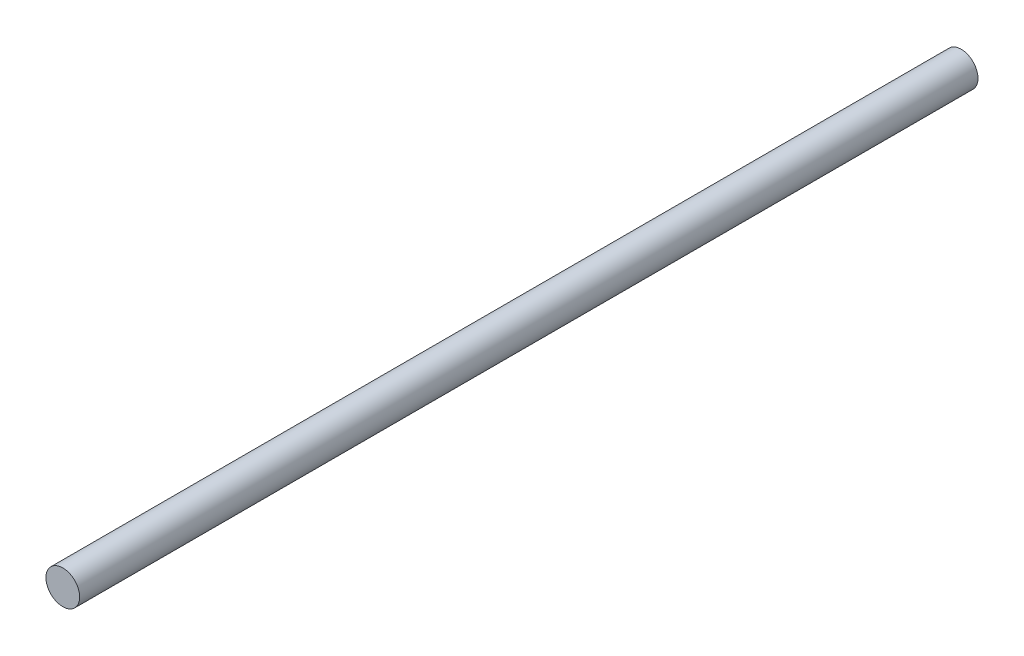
from build123d import *

# Parameters (mm, degrees)
SKETCH1_R           = 30
BOSS_EXTRUDE1_DEPTH = 1600


with BuildPart() as part:
    # Sketch1 → Boss-Extrude1 (new body)
    with BuildSketch(Plane.XY):
        Circle(SKETCH1_R)
    extrude(amount=-BOSS_EXTRUDE1_DEPTH)


solid = part.part
